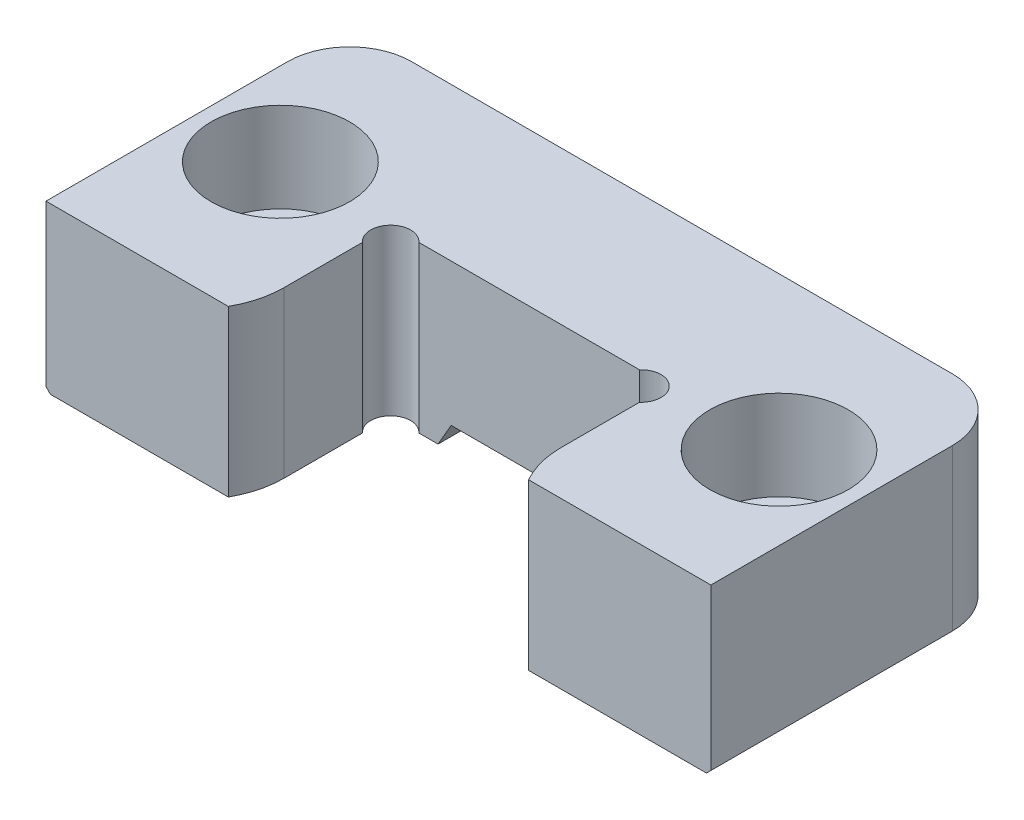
ISO-10303-21;
HEADER;
FILE_DESCRIPTION(('STEP AP214'),'2;1');
FILE_NAME('part.step','',(''),(''),'','','');
FILE_SCHEMA(('AUTOMOTIVE_DESIGN { 1 0 10303 214 1 1 1 1 }'));
ENDSEC;
DATA;
#1=APPLICATION_CONTEXT('core data for automotive mechanical design processes');
#2=APPLICATION_PROTOCOL_DEFINITION('international standard','automotive_design',2000,#1);
#3=PRODUCT_CONTEXT('',#1,'mechanical');
#4=PRODUCT('Part','Part','',(#3));
#5=PRODUCT_RELATED_PRODUCT_CATEGORY('part','',(#4));
#6=PRODUCT_DEFINITION_FORMATION('','',#4);
#7=PRODUCT_DEFINITION_CONTEXT('part definition',#1,'design');
#8=PRODUCT_DEFINITION('design','',#6,#7);
#9=PRODUCT_DEFINITION_SHAPE('','',#8);
#10=(LENGTH_UNIT() NAMED_UNIT(*) SI_UNIT(.MILLI.,.METRE.));
#11=(NAMED_UNIT(*) PLANE_ANGLE_UNIT() SI_UNIT($,.RADIAN.));
#12=(NAMED_UNIT(*) SI_UNIT($,.STERADIAN.) SOLID_ANGLE_UNIT());
#13=UNCERTAINTY_MEASURE_WITH_UNIT(LENGTH_MEASURE(1.E-05),#10,'distance_accuracy_value','');
#14=(GEOMETRIC_REPRESENTATION_CONTEXT(3) GLOBAL_UNCERTAINTY_ASSIGNED_CONTEXT((#13)) GLOBAL_UNIT_ASSIGNED_CONTEXT((#10,
#11,#12)) REPRESENTATION_CONTEXT('',''));
#15=CARTESIAN_POINT('',(0.,0.,0.));
#16=DIRECTION('',(0.,0.,1.));
#17=DIRECTION('',(1.,0.,0.));
#18=AXIS2_PLACEMENT_3D('',#15,#16,#17);
#19=CARTESIAN_POINT('',(-38.1,-18.923,-34.798));
#20=DIRECTION('',(0.,-1.,0.));
#21=DIRECTION('',(0.,0.,-1.));
#22=AXIS2_PLACEMENT_3D('',#19,#20,#21);
#23=PLANE('',#22);
#24=CARTESIAN_POINT('',(-28.575,-18.923,-17.3355));
#25=DIRECTION('',(0.,1.,0.));
#26=DIRECTION('',(0.,0.,1.));
#27=AXIS2_PLACEMENT_3D('',#24,#25,#26);
#28=CIRCLE('',#27,5.15873999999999);
#29=CARTESIAN_POINT('',(-28.575,-18.923,-12.17676));
#30=VERTEX_POINT('',#29);
#31=EDGE_CURVE('E498',#30,#30,#28,.T.);
#32=ORIENTED_EDGE('',*,*,#31,.T.);
#33=EDGE_LOOP('',(#32));
#34=FACE_BOUND('',#33,.T.);
#35=CARTESIAN_POINT('',(-30.988,-18.923,-27.686));
#36=DIRECTION('',(0.,-1.,0.));
#37=DIRECTION('',(0.,0.,-1.));
#38=AXIS2_PLACEMENT_3D('',#35,#36,#37);
#39=CIRCLE('',#38,6.604);
#40=CARTESIAN_POINT('',(-37.592,-18.923,-27.686));
#41=VERTEX_POINT('',#40);
#42=CARTESIAN_POINT('',(-30.988,-18.923,-34.29));
#43=VERTEX_POINT('',#42);
#44=EDGE_CURVE('E342',#41,#43,#39,.T.);
#45=ORIENTED_EDGE('',*,*,#44,.T.);
#46=DIRECTION('',(1.,0.,0.));
#47=VECTOR('',#46,1.);
#48=CARTESIAN_POINT('',(-38.1,-18.923,-34.29));
#49=LINE('',#48,#47);
#50=CARTESIAN_POINT('',(-10.4415435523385,-18.923,-34.29));
#51=VERTEX_POINT('',#50);
#52=EDGE_CURVE('E344',#43,#51,#49,.T.);
#53=ORIENTED_EDGE('',*,*,#52,.T.);
#54=DIRECTION('',(0.,0.,-1.));
#55=VECTOR('',#54,1.);
#56=CARTESIAN_POINT('',(-10.4415435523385,-18.923,-34.798));
#57=LINE('',#56,#55);
#58=CARTESIAN_POINT('',(-10.4415435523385,-18.923,-17.272));
#59=VERTEX_POINT('',#58);
#60=EDGE_CURVE('E319',#59,#51,#57,.T.);
#61=ORIENTED_EDGE('',*,*,#60,.F.);
#62=DIRECTION('',(1.,0.,0.));
#63=VECTOR('',#62,1.);
#64=CARTESIAN_POINT('',(-15.875,-18.923,-17.272));
#65=LINE('',#64,#63);
#66=CARTESIAN_POINT('',(-12.6471162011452,-18.923,-17.272));
#67=VERTEX_POINT('',#66);
#68=EDGE_CURVE('E270',#67,#59,#65,.T.);
#69=ORIENTED_EDGE('',*,*,#68,.F.);
#70=CARTESIAN_POINT('',(-14.351,-18.923,-15.748));
#71=DIRECTION('',(0.,1.,0.));
#72=DIRECTION('',(0.,0.,1.));
#73=AXIS2_PLACEMENT_3D('',#70,#71,#72);
#74=CIRCLE('',#73,2.286);
#75=CARTESIAN_POINT('',(-15.875,-18.923,-14.0441162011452));
#76=VERTEX_POINT('',#75);
#77=EDGE_CURVE('E232',#67,#76,#74,.T.);
#78=ORIENTED_EDGE('',*,*,#77,.T.);
#79=DIRECTION('',(0.,0.,-1.));
#80=VECTOR('',#79,1.);
#81=CARTESIAN_POINT('',(-15.875,-18.923,0.));
#82=LINE('',#81,#80);
#83=CARTESIAN_POINT('',(-15.875,-18.923,-5.08));
#84=VERTEX_POINT('',#83);
#85=EDGE_CURVE('E265',#84,#76,#82,.T.);
#86=ORIENTED_EDGE('',*,*,#85,.F.);
#87=CARTESIAN_POINT('',(-26.2282698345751,-18.923,-5.08));
#88=DIRECTION('',(0.,-1.,0.));
#89=DIRECTION('',(0.,0.,1.));
#90=AXIS2_PLACEMENT_3D('',#87,#88,#89);
#91=CIRCLE('',#90,10.3532698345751);
#92=CARTESIAN_POINT('',(-17.2069730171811,-18.923,0.));
#93=VERTEX_POINT('',#92);
#94=EDGE_CURVE('E241',#84,#93,#91,.T.);
#95=ORIENTED_EDGE('',*,*,#94,.T.);
#96=DIRECTION('',(1.,0.,0.));
#97=VECTOR('',#96,1.);
#98=CARTESIAN_POINT('',(-38.1,-18.923,0.));
#99=LINE('',#98,#97);
#100=CARTESIAN_POINT('',(-37.592,-18.923,0.));
#101=VERTEX_POINT('',#100);
#102=EDGE_CURVE('E263',#101,#93,#99,.T.);
#103=ORIENTED_EDGE('',*,*,#102,.F.);
#104=DIRECTION('',(0.,0.,-1.));
#105=VECTOR('',#104,1.);
#106=CARTESIAN_POINT('',(-37.592,-18.923,-34.798));
#107=LINE('',#106,#105);
#108=EDGE_CURVE('E340',#101,#41,#107,.T.);
#109=ORIENTED_EDGE('',*,*,#108,.T.);
#110=EDGE_LOOP('',(#45,#53,#61,#69,#78,#86,#95,#103,#109));
#111=FACE_BOUND('',#110,.T.);
#112=ADVANCED_FACE('F34',(#34,#111),#23,.T.);
#113=CARTESIAN_POINT('',(-38.1,-18.923,0.));
#114=DIRECTION('',(-1.,0.,0.));
#115=DIRECTION('',(0.,0.,1.));
#116=AXIS2_PLACEMENT_3D('',#113,#114,#115);
#117=PLANE('',#116);
#118=DIRECTION('',(0.,1.,0.));
#119=VECTOR('',#118,1.);
#120=CARTESIAN_POINT('',(-38.1,-18.923,-27.686));
#121=LINE('',#120,#119);
#122=CARTESIAN_POINT('',(-38.1,0.,-27.686));
#123=VERTEX_POINT('',#122);
#124=CARTESIAN_POINT('',(-38.1,-18.415,-27.686));
#125=VERTEX_POINT('',#124);
#126=EDGE_CURVE('E311',#123,#125,#121,.F.);
#127=ORIENTED_EDGE('',*,*,#126,.T.);
#128=DIRECTION('',(0.,0.,1.));
#129=VECTOR('',#128,1.);
#130=CARTESIAN_POINT('',(-38.1,-18.415,0.));
#131=LINE('',#130,#129);
#132=CARTESIAN_POINT('',(-38.1,-18.415,0.));
#133=VERTEX_POINT('',#132);
#134=EDGE_CURVE('E349',#125,#133,#131,.T.);
#135=ORIENTED_EDGE('',*,*,#134,.T.);
#136=DIRECTION('',(0.,1.,0.));
#137=VECTOR('',#136,1.);
#138=CARTESIAN_POINT('',(-38.1,-18.923,0.));
#139=LINE('',#138,#137);
#140=CARTESIAN_POINT('',(-38.1,0.,0.));
#141=VERTEX_POINT('',#140);
#142=EDGE_CURVE('E277',#133,#141,#139,.T.);
#143=ORIENTED_EDGE('',*,*,#142,.T.);
#144=DIRECTION('',(0.,0.,1.));
#145=VECTOR('',#144,1.);
#146=CARTESIAN_POINT('',(-38.1,0.,0.));
#147=LINE('',#146,#145);
#148=EDGE_CURVE('E255',#123,#141,#147,.T.);
#149=ORIENTED_EDGE('',*,*,#148,.F.);
#150=EDGE_LOOP('',(#127,#135,#143,#149));
#151=FACE_BOUND('',#150,.T.);
#152=ADVANCED_FACE('F424',(#151),#117,.T.);
#153=CARTESIAN_POINT('',(-38.1,-18.923,-34.798));
#154=DIRECTION('',(0.,0.,-1.));
#155=DIRECTION('',(-1.,0.,0.));
#156=AXIS2_PLACEMENT_3D('',#153,#154,#155);
#157=PLANE('',#156);
#158=DIRECTION('',(0.,1.,0.));
#159=VECTOR('',#158,1.);
#160=CARTESIAN_POINT('',(30.988,-18.923,-34.798));
#161=LINE('',#160,#159);
#162=CARTESIAN_POINT('',(30.988,0.,-34.798));
#163=VERTEX_POINT('',#162);
#164=CARTESIAN_POINT('',(30.988,-18.415,-34.798));
#165=VERTEX_POINT('',#164);
#166=EDGE_CURVE('E309',#163,#165,#161,.F.);
#167=ORIENTED_EDGE('',*,*,#166,.T.);
#168=DIRECTION('',(-1.,0.,0.));
#169=VECTOR('',#168,1.);
#170=CARTESIAN_POINT('',(-38.1,-18.415,-34.798));
#171=LINE('',#170,#169);
#172=CARTESIAN_POINT('',(10.1482496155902,-18.415,-34.798));
#173=VERTEX_POINT('',#172);
#174=EDGE_CURVE('E336',#165,#173,#171,.T.);
#175=ORIENTED_EDGE('',*,*,#174,.T.);
#176=DIRECTION('',(0.5,-0.866025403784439,0.));
#177=VECTOR('',#176,1.);
#178=CARTESIAN_POINT('',(9.525,-17.3355,-34.798));
#179=LINE('',#178,#177);
#180=CARTESIAN_POINT('',(9.525,-17.3355,-34.798));
#181=VERTEX_POINT('',#180);
#182=EDGE_CURVE('E200',#181,#173,#179,.T.);
#183=ORIENTED_EDGE('',*,*,#182,.F.);
#184=DIRECTION('',(1.,0.,0.));
#185=VECTOR('',#184,1.);
#186=CARTESIAN_POINT('',(9.525,-17.3355,-34.798));
#187=LINE('',#186,#185);
#188=CARTESIAN_POINT('',(-9.525,-17.3355,-34.798));
#189=VERTEX_POINT('',#188);
#190=EDGE_CURVE('E194',#189,#181,#187,.T.);
#191=ORIENTED_EDGE('',*,*,#190,.F.);
#192=DIRECTION('',(0.5,0.866025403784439,0.));
#193=VECTOR('',#192,1.);
#194=CARTESIAN_POINT('',(-9.525,-17.3355,-34.798));
#195=LINE('',#194,#193);
#196=CARTESIAN_POINT('',(-10.1482496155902,-18.415,-34.798));
#197=VERTEX_POINT('',#196);
#198=EDGE_CURVE('E203',#197,#189,#195,.T.);
#199=ORIENTED_EDGE('',*,*,#198,.F.);
#200=DIRECTION('',(-1.,0.,0.));
#201=VECTOR('',#200,1.);
#202=CARTESIAN_POINT('',(-38.1,-18.415,-34.798));
#203=LINE('',#202,#201);
#204=CARTESIAN_POINT('',(-30.988,-18.415,-34.798));
#205=VERTEX_POINT('',#204);
#206=EDGE_CURVE('E334',#197,#205,#203,.T.);
#207=ORIENTED_EDGE('',*,*,#206,.T.);
#208=DIRECTION('',(0.,1.,0.));
#209=VECTOR('',#208,1.);
#210=CARTESIAN_POINT('',(-30.988,-18.923,-34.798));
#211=LINE('',#210,#209);
#212=CARTESIAN_POINT('',(-30.988,0.,-34.798));
#213=VERTEX_POINT('',#212);
#214=EDGE_CURVE('E307',#205,#213,#211,.T.);
#215=ORIENTED_EDGE('',*,*,#214,.T.);
#216=DIRECTION('',(-1.,0.,0.));
#217=VECTOR('',#216,1.);
#218=CARTESIAN_POINT('',(-38.1,0.,-34.798));
#219=LINE('',#218,#217);
#220=EDGE_CURVE('E266',#163,#213,#219,.T.);
#221=ORIENTED_EDGE('',*,*,#220,.F.);
#222=EDGE_LOOP('',(#167,#175,#183,#191,#199,#207,#215,#221));
#223=FACE_BOUND('',#222,.T.);
#224=ADVANCED_FACE('F214',(#223),#157,.T.);
#225=CARTESIAN_POINT('',(38.1,-18.923,0.));
#226=DIRECTION('',(1.,0.,0.));
#227=DIRECTION('',(0.,0.,-1.));
#228=AXIS2_PLACEMENT_3D('',#225,#226,#227);
#229=PLANE('',#228);
#230=DIRECTION('',(0.,1.,0.));
#231=VECTOR('',#230,1.);
#232=CARTESIAN_POINT('',(38.1,-18.923,0.));
#233=LINE('',#232,#231);
#234=CARTESIAN_POINT('',(38.1,-18.415,0.));
#235=VERTEX_POINT('',#234);
#236=CARTESIAN_POINT('',(38.1,0.,0.));
#237=VERTEX_POINT('',#236);
#238=EDGE_CURVE('E298',#235,#237,#233,.T.);
#239=ORIENTED_EDGE('',*,*,#238,.F.);
#240=DIRECTION('',(0.,0.,-1.));
#241=VECTOR('',#240,1.);
#242=CARTESIAN_POINT('',(38.1,-18.415,0.));
#243=LINE('',#242,#241);
#244=CARTESIAN_POINT('',(38.1,-18.415,-27.686));
#245=VERTEX_POINT('',#244);
#246=EDGE_CURVE('E321',#235,#245,#243,.T.);
#247=ORIENTED_EDGE('',*,*,#246,.T.);
#248=DIRECTION('',(0.,1.,0.));
#249=VECTOR('',#248,1.);
#250=CARTESIAN_POINT('',(38.1,-18.923,-27.686));
#251=LINE('',#250,#249);
#252=CARTESIAN_POINT('',(38.1,0.,-27.686));
#253=VERTEX_POINT('',#252);
#254=EDGE_CURVE('E300',#245,#253,#251,.T.);
#255=ORIENTED_EDGE('',*,*,#254,.T.);
#256=DIRECTION('',(0.,0.,-1.));
#257=VECTOR('',#256,1.);
#258=CARTESIAN_POINT('',(38.1,0.,0.));
#259=LINE('',#258,#257);
#260=EDGE_CURVE('E293',#237,#253,#259,.T.);
#261=ORIENTED_EDGE('',*,*,#260,.F.);
#262=EDGE_LOOP('',(#239,#247,#255,#261));
#263=FACE_BOUND('',#262,.T.);
#264=ADVANCED_FACE('F410',(#263),#229,.T.);
#265=CARTESIAN_POINT('',(15.875,-18.923,0.));
#266=DIRECTION('',(0.,0.,1.));
#267=DIRECTION('',(1.,0.,0.));
#268=AXIS2_PLACEMENT_3D('',#265,#266,#267);
#269=PLANE('',#268);
#270=DIRECTION('',(1.,0.,0.));
#271=VECTOR('',#270,1.);
#272=CARTESIAN_POINT('',(15.875,-18.923,0.));
#273=LINE('',#272,#271);
#274=CARTESIAN_POINT('',(17.2069730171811,-18.923,0.));
#275=VERTEX_POINT('',#274);
#276=CARTESIAN_POINT('',(37.592,-18.923,0.));
#277=VERTEX_POINT('',#276);
#278=EDGE_CURVE('E274',#275,#277,#273,.T.);
#279=ORIENTED_EDGE('',*,*,#278,.T.);
#280=DIRECTION('',(-0.707106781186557,-0.707106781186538,0.));
#281=VECTOR('',#280,1.);
#282=CARTESIAN_POINT('',(26.7334999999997,-29.7815,0.));
#283=LINE('',#282,#281);
#284=EDGE_CURVE('E330',#277,#235,#283,.F.);
#285=ORIENTED_EDGE('',*,*,#284,.T.);
#286=ORIENTED_EDGE('',*,*,#238,.T.);
#287=DIRECTION('',(1.,0.,0.));
#288=VECTOR('',#287,1.);
#289=CARTESIAN_POINT('',(15.875,0.,0.));
#290=LINE('',#289,#288);
#291=CARTESIAN_POINT('',(17.2069730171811,0.,0.));
#292=VERTEX_POINT('',#291);
#293=EDGE_CURVE('E290',#292,#237,#290,.T.);
#294=ORIENTED_EDGE('',*,*,#293,.F.);
#295=DIRECTION('',(0.,1.,0.));
#296=VECTOR('',#295,1.);
#297=CARTESIAN_POINT('',(17.2069730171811,-18.923,0.));
#298=LINE('',#297,#296);
#299=EDGE_CURVE('E259',#275,#292,#298,.T.);
#300=ORIENTED_EDGE('',*,*,#299,.F.);
#301=EDGE_LOOP('',(#279,#285,#286,#294,#300));
#302=FACE_BOUND('',#301,.T.);
#303=ADVANCED_FACE('F393',(#302),#269,.T.);
#304=CARTESIAN_POINT('',(15.875,-18.923,0.));
#305=DIRECTION('',(-1.,0.,0.));
#306=DIRECTION('',(0.,0.,1.));
#307=AXIS2_PLACEMENT_3D('',#304,#305,#306);
#308=PLANE('',#307);
#309=DIRECTION('',(0.,1.,0.));
#310=VECTOR('',#309,1.);
#311=CARTESIAN_POINT('',(15.875,-18.923,-14.0441162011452));
#312=LINE('',#311,#310);
#313=CARTESIAN_POINT('',(15.875,-18.923,-14.0441162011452));
#314=VERTEX_POINT('',#313);
#315=CARTESIAN_POINT('',(15.875,0.,-14.0441162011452));
#316=VERTEX_POINT('',#315);
#317=EDGE_CURVE('E229',#314,#316,#312,.T.);
#318=ORIENTED_EDGE('',*,*,#317,.F.);
#319=DIRECTION('',(0.,0.,1.));
#320=VECTOR('',#319,1.);
#321=CARTESIAN_POINT('',(15.875,-18.923,0.));
#322=LINE('',#321,#320);
#323=CARTESIAN_POINT('',(15.875,-18.923,-5.08));
#324=VERTEX_POINT('',#323);
#325=EDGE_CURVE('E272',#314,#324,#322,.T.);
#326=ORIENTED_EDGE('',*,*,#325,.T.);
#327=DIRECTION('',(0.,1.,0.));
#328=VECTOR('',#327,1.);
#329=CARTESIAN_POINT('',(15.875,-18.923,-5.08));
#330=LINE('',#329,#328);
#331=CARTESIAN_POINT('',(15.875,0.,-5.08));
#332=VERTEX_POINT('',#331);
#333=EDGE_CURVE('E256',#324,#332,#330,.T.);
#334=ORIENTED_EDGE('',*,*,#333,.T.);
#335=DIRECTION('',(0.,0.,1.));
#336=VECTOR('',#335,1.);
#337=CARTESIAN_POINT('',(15.875,0.,0.));
#338=LINE('',#337,#336);
#339=EDGE_CURVE('E288',#316,#332,#338,.T.);
#340=ORIENTED_EDGE('',*,*,#339,.F.);
#341=EDGE_LOOP('',(#318,#326,#334,#340));
#342=FACE_BOUND('',#341,.T.);
#343=ADVANCED_FACE('F382',(#342),#308,.T.);
#344=CARTESIAN_POINT('',(-15.875,-18.923,-17.272));
#345=DIRECTION('',(0.,0.,1.));
#346=DIRECTION('',(1.,0.,0.));
#347=AXIS2_PLACEMENT_3D('',#344,#345,#346);
#348=PLANE('',#347);
#349=DIRECTION('',(-0.5,-0.866025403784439,0.));
#350=VECTOR('',#349,1.);
#351=CARTESIAN_POINT('',(-11.7999076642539,-21.2757556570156,-17.272));
#352=LINE('',#351,#350);
#353=CARTESIAN_POINT('',(-8.93559094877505,-16.3146135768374,-17.272));
#354=VERTEX_POINT('',#353);
#355=EDGE_CURVE('E49',#354,#59,#352,.T.);
#356=ORIENTED_EDGE('',*,*,#355,.F.);
#357=DIRECTION('',(1.,0.,0.));
#358=VECTOR('',#357,1.);
#359=CARTESIAN_POINT('',(9.525,-16.3146135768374,-17.272));
#360=LINE('',#359,#358);
#361=CARTESIAN_POINT('',(8.93559094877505,-16.3146135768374,-17.272));
#362=VERTEX_POINT('',#361);
#363=EDGE_CURVE('E364',#354,#362,#360,.T.);
#364=ORIENTED_EDGE('',*,*,#363,.T.);
#365=DIRECTION('',(-0.5,0.866025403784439,0.));
#366=VECTOR('',#365,1.);
#367=CARTESIAN_POINT('',(3.8624076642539,-7.52760237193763,-17.272));
#368=LINE('',#367,#366);
#369=CARTESIAN_POINT('',(10.4415435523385,-18.923,-17.272));
#370=VERTEX_POINT('',#369);
#371=EDGE_CURVE('E56',#370,#362,#368,.T.);
#372=ORIENTED_EDGE('',*,*,#371,.F.);
#373=CARTESIAN_POINT('',(12.6471162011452,-18.923,-17.272));
#374=VERTEX_POINT('',#373);
#375=EDGE_CURVE('E269',#370,#374,#65,.T.);
#376=ORIENTED_EDGE('',*,*,#375,.T.);
#377=DIRECTION('',(0.,1.,0.));
#378=VECTOR('',#377,1.);
#379=CARTESIAN_POINT('',(12.6471162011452,-18.923,-17.272));
#380=LINE('',#379,#378);
#381=CARTESIAN_POINT('',(12.6471162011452,0.,-17.272));
#382=VERTEX_POINT('',#381);
#383=EDGE_CURVE('E226',#382,#374,#380,.F.);
#384=ORIENTED_EDGE('',*,*,#383,.F.);
#385=DIRECTION('',(1.,0.,0.));
#386=VECTOR('',#385,1.);
#387=CARTESIAN_POINT('',(-15.875,0.,-17.272));
#388=LINE('',#387,#386);
#389=CARTESIAN_POINT('',(-12.6471162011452,0.,-17.272));
#390=VERTEX_POINT('',#389);
#391=EDGE_CURVE('E285',#390,#382,#388,.T.);
#392=ORIENTED_EDGE('',*,*,#391,.F.);
#393=DIRECTION('',(0.,1.,0.));
#394=VECTOR('',#393,1.);
#395=CARTESIAN_POINT('',(-12.6471162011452,-18.923,-17.272));
#396=LINE('',#395,#394);
#397=EDGE_CURVE('E238',#67,#390,#396,.T.);
#398=ORIENTED_EDGE('',*,*,#397,.F.);
#399=ORIENTED_EDGE('',*,*,#68,.T.);
#400=EDGE_LOOP('',(#356,#364,#372,#376,#384,#392,#398,#399));
#401=FACE_BOUND('',#400,.T.);
#402=ADVANCED_FACE('F369',(#401),#348,.T.);
#403=CARTESIAN_POINT('',(-15.875,-18.923,0.));
#404=DIRECTION('',(1.,0.,0.));
#405=DIRECTION('',(0.,0.,-1.));
#406=AXIS2_PLACEMENT_3D('',#403,#404,#405);
#407=PLANE('',#406);
#408=DIRECTION('',(0.,1.,0.));
#409=VECTOR('',#408,1.);
#410=CARTESIAN_POINT('',(-15.875,-18.923,-14.0441162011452));
#411=LINE('',#410,#409);
#412=CARTESIAN_POINT('',(-15.875,0.,-14.0441162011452));
#413=VERTEX_POINT('',#412);
#414=EDGE_CURVE('E235',#413,#76,#411,.F.);
#415=ORIENTED_EDGE('',*,*,#414,.F.);
#416=DIRECTION('',(0.,0.,-1.));
#417=VECTOR('',#416,1.);
#418=CARTESIAN_POINT('',(-15.875,0.,0.));
#419=LINE('',#418,#417);
#420=CARTESIAN_POINT('',(-15.875,0.,-5.08));
#421=VERTEX_POINT('',#420);
#422=EDGE_CURVE('E282',#421,#413,#419,.T.);
#423=ORIENTED_EDGE('',*,*,#422,.F.);
#424=DIRECTION('',(0.,1.,0.));
#425=VECTOR('',#424,1.);
#426=CARTESIAN_POINT('',(-15.875,-18.923,-5.08));
#427=LINE('',#426,#425);
#428=EDGE_CURVE('E253',#84,#421,#427,.T.);
#429=ORIENTED_EDGE('',*,*,#428,.F.);
#430=ORIENTED_EDGE('',*,*,#85,.T.);
#431=EDGE_LOOP('',(#415,#423,#429,#430));
#432=FACE_BOUND('',#431,.T.);
#433=ADVANCED_FACE('F448',(#432),#407,.T.);
#434=CARTESIAN_POINT('',(-38.1,-18.923,0.));
#435=DIRECTION('',(0.,0.,1.));
#436=DIRECTION('',(1.,0.,0.));
#437=AXIS2_PLACEMENT_3D('',#434,#435,#436);
#438=PLANE('',#437);
#439=ORIENTED_EDGE('',*,*,#142,.F.);
#440=DIRECTION('',(-0.707106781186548,0.707106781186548,0.));
#441=VECTOR('',#440,1.);
#442=CARTESIAN_POINT('',(-37.846,-18.669,0.));
#443=LINE('',#442,#441);
#444=EDGE_CURVE('E351',#133,#101,#443,.F.);
#445=ORIENTED_EDGE('',*,*,#444,.T.);
#446=ORIENTED_EDGE('',*,*,#102,.T.);
#447=DIRECTION('',(0.,1.,0.));
#448=VECTOR('',#447,1.);
#449=CARTESIAN_POINT('',(-17.2069730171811,-18.923,0.));
#450=LINE('',#449,#448);
#451=CARTESIAN_POINT('',(-17.2069730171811,0.,0.));
#452=VERTEX_POINT('',#451);
#453=EDGE_CURVE('E248',#93,#452,#450,.T.);
#454=ORIENTED_EDGE('',*,*,#453,.T.);
#455=DIRECTION('',(1.,0.,0.));
#456=VECTOR('',#455,1.);
#457=CARTESIAN_POINT('',(-38.1,0.,0.));
#458=LINE('',#457,#456);
#459=EDGE_CURVE('E280',#141,#452,#458,.T.);
#460=ORIENTED_EDGE('',*,*,#459,.F.);
#461=EDGE_LOOP('',(#439,#445,#446,#454,#460));
#462=FACE_BOUND('',#461,.T.);
#463=ADVANCED_FACE('F429',(#462),#438,.T.);
#464=CARTESIAN_POINT('',(28.575,-18.923,-17.3355));
#465=DIRECTION('',(0.,1.,0.));
#466=DIRECTION('',(0.,0.,1.));
#467=AXIS2_PLACEMENT_3D('',#464,#465,#466);
#468=CIRCLE('',#467,5.15873999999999);
#469=CARTESIAN_POINT('',(28.575,-18.923,-12.17676));
#470=VERTEX_POINT('',#469);
#471=EDGE_CURVE('E360',#470,#470,#468,.T.);
#472=ORIENTED_EDGE('',*,*,#471,.T.);
#473=EDGE_LOOP('',(#472));
#474=FACE_BOUND('',#473,.T.);
#475=CARTESIAN_POINT('',(30.988,-18.923,-27.686));
#476=DIRECTION('',(0.,-1.,0.));
#477=DIRECTION('',(0.,0.,-1.));
#478=AXIS2_PLACEMENT_3D('',#475,#476,#477);
#479=CIRCLE('',#478,6.60399999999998);
#480=CARTESIAN_POINT('',(30.988,-18.923,-34.29));
#481=VERTEX_POINT('',#480);
#482=CARTESIAN_POINT('',(37.592,-18.923,-27.686));
#483=VERTEX_POINT('',#482);
#484=EDGE_CURVE('E326',#481,#483,#479,.T.);
#485=ORIENTED_EDGE('',*,*,#484,.T.);
#486=DIRECTION('',(0.,0.,1.));
#487=VECTOR('',#486,1.);
#488=CARTESIAN_POINT('',(37.592,-18.923,-34.798));
#489=LINE('',#488,#487);
#490=EDGE_CURVE('E328',#483,#277,#489,.T.);
#491=ORIENTED_EDGE('',*,*,#490,.T.);
#492=ORIENTED_EDGE('',*,*,#278,.F.);
#493=CARTESIAN_POINT('',(26.2282698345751,-18.923,-5.08));
#494=DIRECTION('',(0.,-1.,0.));
#495=DIRECTION('',(0.,0.,-1.));
#496=AXIS2_PLACEMENT_3D('',#493,#494,#495);
#497=CIRCLE('',#496,10.3532698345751);
#498=EDGE_CURVE('E244',#275,#324,#497,.T.);
#499=ORIENTED_EDGE('',*,*,#498,.T.);
#500=ORIENTED_EDGE('',*,*,#325,.F.);
#501=CARTESIAN_POINT('',(14.351,-18.923,-15.748));
#502=DIRECTION('',(0.,1.,0.));
#503=DIRECTION('',(0.,0.,-1.));
#504=AXIS2_PLACEMENT_3D('',#501,#502,#503);
#505=CIRCLE('',#504,2.286);
#506=EDGE_CURVE('E223',#314,#374,#505,.T.);
#507=ORIENTED_EDGE('',*,*,#506,.T.);
#508=ORIENTED_EDGE('',*,*,#375,.F.);
#509=DIRECTION('',(0.,0.,1.));
#510=VECTOR('',#509,1.);
#511=CARTESIAN_POINT('',(10.4415435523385,-18.923,-34.798));
#512=LINE('',#511,#510);
#513=CARTESIAN_POINT('',(10.4415435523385,-18.923,-34.29));
#514=VERTEX_POINT('',#513);
#515=EDGE_CURVE('E317',#514,#370,#512,.T.);
#516=ORIENTED_EDGE('',*,*,#515,.F.);
#517=DIRECTION('',(1.,0.,0.));
#518=VECTOR('',#517,1.);
#519=CARTESIAN_POINT('',(-38.1,-18.923,-34.29));
#520=LINE('',#519,#518);
#521=EDGE_CURVE('E324',#514,#481,#520,.T.);
#522=ORIENTED_EDGE('',*,*,#521,.T.);
#523=EDGE_LOOP('',(#485,#491,#492,#499,#500,#507,#508,#516,#522));
#524=FACE_BOUND('',#523,.T.);
#525=ADVANCED_FACE('F374',(#474,#524),#23,.T.);
#526=CARTESIAN_POINT('',(-38.1,0.,-34.798));
#527=DIRECTION('',(0.,-1.,0.));
#528=DIRECTION('',(0.,0.,-1.));
#529=AXIS2_PLACEMENT_3D('',#526,#527,#528);
#530=PLANE('',#529);
#531=CARTESIAN_POINT('',(-28.575,0.,-17.3355));
#532=DIRECTION('',(0.,1.,0.));
#533=DIRECTION('',(0.,0.,1.));
#534=AXIS2_PLACEMENT_3D('',#531,#532,#533);
#535=CIRCLE('',#534,7.9375);
#536=CARTESIAN_POINT('',(-28.575,0.,-9.398));
#537=VERTEX_POINT('',#536);
#538=EDGE_CURVE('E506',#537,#537,#535,.T.);
#539=ORIENTED_EDGE('',*,*,#538,.F.);
#540=EDGE_LOOP('',(#539));
#541=FACE_BOUND('',#540,.T.);
#542=CARTESIAN_POINT('',(28.575,0.,-17.3355));
#543=DIRECTION('',(0.,1.,0.));
#544=DIRECTION('',(0.,0.,1.));
#545=AXIS2_PLACEMENT_3D('',#542,#543,#544);
#546=CIRCLE('',#545,7.9375);
#547=CARTESIAN_POINT('',(28.575,0.,-9.398));
#548=VERTEX_POINT('',#547);
#549=EDGE_CURVE('E495',#548,#548,#546,.T.);
#550=ORIENTED_EDGE('',*,*,#549,.F.);
#551=EDGE_LOOP('',(#550));
#552=FACE_BOUND('',#551,.T.);
#553=ORIENTED_EDGE('',*,*,#391,.T.);
#554=CARTESIAN_POINT('',(14.351,0.,-15.748));
#555=DIRECTION('',(0.,-1.,0.));
#556=DIRECTION('',(0.,0.,-1.));
#557=AXIS2_PLACEMENT_3D('',#554,#555,#556);
#558=CIRCLE('',#557,2.286);
#559=EDGE_CURVE('E314',#382,#316,#558,.T.);
#560=ORIENTED_EDGE('',*,*,#559,.T.);
#561=ORIENTED_EDGE('',*,*,#339,.T.);
#562=CARTESIAN_POINT('',(26.2282698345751,0.,-5.08));
#563=DIRECTION('',(0.,-1.,0.));
#564=DIRECTION('',(0.,0.,-1.));
#565=AXIS2_PLACEMENT_3D('',#562,#563,#564);
#566=CIRCLE('',#565,10.3532698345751);
#567=EDGE_CURVE('E245',#292,#332,#566,.T.);
#568=ORIENTED_EDGE('',*,*,#567,.F.);
#569=ORIENTED_EDGE('',*,*,#293,.T.);
#570=ORIENTED_EDGE('',*,*,#260,.T.);
#571=CARTESIAN_POINT('',(30.988,0.,-27.686));
#572=DIRECTION('',(0.,-1.,0.));
#573=DIRECTION('',(0.,0.,-1.));
#574=AXIS2_PLACEMENT_3D('',#571,#572,#573);
#575=CIRCLE('',#574,7.112);
#576=EDGE_CURVE('E305',#253,#163,#575,.F.);
#577=ORIENTED_EDGE('',*,*,#576,.T.);
#578=ORIENTED_EDGE('',*,*,#220,.T.);
#579=CARTESIAN_POINT('',(-30.988,0.,-27.686));
#580=DIRECTION('',(0.,-1.,0.));
#581=DIRECTION('',(0.,0.,-1.));
#582=AXIS2_PLACEMENT_3D('',#579,#580,#581);
#583=CIRCLE('',#582,7.112);
#584=EDGE_CURVE('E303',#213,#123,#583,.F.);
#585=ORIENTED_EDGE('',*,*,#584,.T.);
#586=ORIENTED_EDGE('',*,*,#148,.T.);
#587=ORIENTED_EDGE('',*,*,#459,.T.);
#588=CARTESIAN_POINT('',(-26.2282698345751,0.,-5.08));
#589=DIRECTION('',(0.,-1.,0.));
#590=DIRECTION('',(0.,0.,1.));
#591=AXIS2_PLACEMENT_3D('',#588,#589,#590);
#592=CIRCLE('',#591,10.3532698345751);
#593=EDGE_CURVE('E240',#421,#452,#592,.T.);
#594=ORIENTED_EDGE('',*,*,#593,.F.);
#595=ORIENTED_EDGE('',*,*,#422,.T.);
#596=CARTESIAN_POINT('',(-14.351,0.,-15.748));
#597=DIRECTION('',(0.,1.,0.));
#598=DIRECTION('',(0.,0.,1.));
#599=AXIS2_PLACEMENT_3D('',#596,#597,#598);
#600=CIRCLE('',#599,2.286);
#601=EDGE_CURVE('E231',#390,#413,#600,.T.);
#602=ORIENTED_EDGE('',*,*,#601,.F.);
#603=EDGE_LOOP('',(#553,#560,#561,#568,#569,#570,#577,#578,#585,#586,#587,#594,#595,#602));
#604=FACE_BOUND('',#603,.T.);
#605=ADVANCED_FACE('F386',(#541,#552,#604),#530,.F.);
#606=CARTESIAN_POINT('',(30.988,-18.923,-27.686));
#607=DIRECTION('',(0.,1.,0.));
#608=DIRECTION('',(0.,0.,1.));
#609=AXIS2_PLACEMENT_3D('',#606,#607,#608);
#610=CYLINDRICAL_SURFACE('',#609,7.112);
#611=ORIENTED_EDGE('',*,*,#254,.F.);
#612=CARTESIAN_POINT('',(30.988,-18.415,-27.686));
#613=DIRECTION('',(0.,-1.,0.));
#614=DIRECTION('',(0.,0.,-1.));
#615=AXIS2_PLACEMENT_3D('',#612,#613,#614);
#616=CIRCLE('',#615,7.112);
#617=EDGE_CURVE('E332',#245,#165,#616,.F.);
#618=ORIENTED_EDGE('',*,*,#617,.T.);
#619=ORIENTED_EDGE('',*,*,#166,.F.);
#620=ORIENTED_EDGE('',*,*,#576,.F.);
#621=EDGE_LOOP('',(#611,#618,#619,#620));
#622=FACE_BOUND('',#621,.T.);
#623=ADVANCED_FACE('F413',(#622),#610,.T.);
#624=CARTESIAN_POINT('',(-30.988,-18.923,-27.686));
#625=DIRECTION('',(0.,1.,0.));
#626=DIRECTION('',(0.,0.,1.));
#627=AXIS2_PLACEMENT_3D('',#624,#625,#626);
#628=CYLINDRICAL_SURFACE('',#627,7.112);
#629=ORIENTED_EDGE('',*,*,#214,.F.);
#630=CARTESIAN_POINT('',(-30.988,-18.415,-27.686));
#631=DIRECTION('',(0.,-1.,0.));
#632=DIRECTION('',(0.,0.,-1.));
#633=AXIS2_PLACEMENT_3D('',#630,#631,#632);
#634=CIRCLE('',#633,7.112);
#635=EDGE_CURVE('E347',#205,#125,#634,.F.);
#636=ORIENTED_EDGE('',*,*,#635,.T.);
#637=ORIENTED_EDGE('',*,*,#126,.F.);
#638=ORIENTED_EDGE('',*,*,#584,.F.);
#639=EDGE_LOOP('',(#629,#636,#637,#638));
#640=FACE_BOUND('',#639,.T.);
#641=ADVANCED_FACE('F420',(#640),#628,.T.);
#642=CARTESIAN_POINT('',(26.2282698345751,-18.923,-5.08));
#643=DIRECTION('',(0.,1.,0.));
#644=DIRECTION('',(0.,0.,1.));
#645=AXIS2_PLACEMENT_3D('',#642,#643,#644);
#646=CYLINDRICAL_SURFACE('',#645,10.3532698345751);
#647=ORIENTED_EDGE('',*,*,#567,.T.);
#648=ORIENTED_EDGE('',*,*,#333,.F.);
#649=ORIENTED_EDGE('',*,*,#498,.F.);
#650=ORIENTED_EDGE('',*,*,#299,.T.);
#651=EDGE_LOOP('',(#647,#648,#649,#650));
#652=FACE_BOUND('',#651,.T.);
#653=ADVANCED_FACE('F389',(#652),#646,.T.);
#654=CARTESIAN_POINT('',(-26.2282698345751,-18.923,-5.08));
#655=DIRECTION('',(0.,1.,0.));
#656=DIRECTION('',(0.,0.,1.));
#657=AXIS2_PLACEMENT_3D('',#654,#655,#656);
#658=CYLINDRICAL_SURFACE('',#657,10.3532698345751);
#659=ORIENTED_EDGE('',*,*,#593,.T.);
#660=ORIENTED_EDGE('',*,*,#453,.F.);
#661=ORIENTED_EDGE('',*,*,#94,.F.);
#662=ORIENTED_EDGE('',*,*,#428,.T.);
#663=EDGE_LOOP('',(#659,#660,#661,#662));
#664=FACE_BOUND('',#663,.T.);
#665=ADVANCED_FACE('F441',(#664),#658,.T.);
#666=CARTESIAN_POINT('',(-14.351,-18.923,-15.748));
#667=DIRECTION('',(0.,1.,0.));
#668=DIRECTION('',(0.,0.,1.));
#669=AXIS2_PLACEMENT_3D('',#666,#667,#668);
#670=CYLINDRICAL_SURFACE('',#669,2.286);
#671=ORIENTED_EDGE('',*,*,#397,.T.);
#672=ORIENTED_EDGE('',*,*,#601,.T.);
#673=ORIENTED_EDGE('',*,*,#414,.T.);
#674=ORIENTED_EDGE('',*,*,#77,.F.);
#675=EDGE_LOOP('',(#671,#672,#673,#674));
#676=FACE_BOUND('',#675,.T.);
#677=ADVANCED_FACE('F450',(#676),#670,.F.);
#678=CARTESIAN_POINT('',(14.351,-18.923,-15.748));
#679=DIRECTION('',(0.,1.,0.));
#680=DIRECTION('',(0.,0.,1.));
#681=AXIS2_PLACEMENT_3D('',#678,#679,#680);
#682=CYLINDRICAL_SURFACE('',#681,2.286);
#683=ORIENTED_EDGE('',*,*,#317,.T.);
#684=ORIENTED_EDGE('',*,*,#559,.F.);
#685=ORIENTED_EDGE('',*,*,#383,.T.);
#686=ORIENTED_EDGE('',*,*,#506,.F.);
#687=EDGE_LOOP('',(#683,#684,#685,#686));
#688=FACE_BOUND('',#687,.T.);
#689=ADVANCED_FACE('F379',(#688),#682,.F.);
#690=CARTESIAN_POINT('',(-9.525,-17.3355,0.));
#691=DIRECTION('',(-0.866025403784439,0.5,0.));
#692=DIRECTION('',(-0.5,-0.866025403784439,0.));
#693=AXIS2_PLACEMENT_3D('',#690,#691,#692);
#694=PLANE('',#693);
#695=ORIENTED_EDGE('',*,*,#60,.T.);
#696=DIRECTION('',(-0.377964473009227,-0.654653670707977,0.654653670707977));
#697=VECTOR('',#696,1.);
#698=CARTESIAN_POINT('',(-14.141356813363,-25.3312645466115,-27.8817354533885));
#699=LINE('',#698,#697);
#700=EDGE_CURVE('E207',#51,#197,#699,.F.);
#701=ORIENTED_EDGE('',*,*,#700,.T.);
#702=ORIENTED_EDGE('',*,*,#198,.T.);
#703=DIRECTION('',(0.,0.,-1.));
#704=VECTOR('',#703,1.);
#705=CARTESIAN_POINT('',(-9.525,-17.3355,0.));
#706=LINE('',#705,#704);
#707=CARTESIAN_POINT('',(-9.525,-17.3355,-21.0820000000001));
#708=VERTEX_POINT('',#707);
#709=EDGE_CURVE('E189',#708,#189,#706,.T.);
#710=ORIENTED_EDGE('',*,*,#709,.F.);
#711=DIRECTION('',(0.147788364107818,0.25597695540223,0.955319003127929));
#712=VECTOR('',#711,1.);
#713=CARTESIAN_POINT('',(-6.54853714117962,-12.1801151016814,-1.84184162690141));
#714=LINE('',#713,#712);
#715=EDGE_CURVE('E42',#708,#354,#714,.T.);
#716=ORIENTED_EDGE('',*,*,#715,.T.);
#717=ORIENTED_EDGE('',*,*,#355,.T.);
#718=EDGE_LOOP('',(#695,#701,#702,#710,#716,#717));
#719=FACE_BOUND('',#718,.T.);
#720=ADVANCED_FACE('F205',(#719),#694,.F.);
#721=CARTESIAN_POINT('',(9.525,-17.3355,0.));
#722=DIRECTION('',(0.866025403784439,0.5,0.));
#723=DIRECTION('',(-0.5,0.866025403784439,0.));
#724=AXIS2_PLACEMENT_3D('',#721,#722,#723);
#725=PLANE('',#724);
#726=ORIENTED_EDGE('',*,*,#182,.T.);
#727=DIRECTION('',(-0.377964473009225,0.654653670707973,-0.654653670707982));
#728=VECTOR('',#727,1.);
#729=CARTESIAN_POINT('',(3.25564252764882,-6.47665432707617,-46.736345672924));
#730=LINE('',#729,#728);
#731=EDGE_CURVE('E338',#173,#514,#730,.F.);
#732=ORIENTED_EDGE('',*,*,#731,.T.);
#733=ORIENTED_EDGE('',*,*,#515,.T.);
#734=ORIENTED_EDGE('',*,*,#371,.T.);
#735=DIRECTION('',(0.147788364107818,-0.25597695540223,-0.955319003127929));
#736=VECTOR('',#735,1.);
#737=CARTESIAN_POINT('',(6.54853714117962,-12.1801151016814,-1.84184162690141));
#738=LINE('',#737,#736);
#739=CARTESIAN_POINT('',(9.525,-17.3355,-21.0820000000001));
#740=VERTEX_POINT('',#739);
#741=EDGE_CURVE('E11',#362,#740,#738,.T.);
#742=ORIENTED_EDGE('',*,*,#741,.T.);
#743=DIRECTION('',(0.,0.,-1.));
#744=VECTOR('',#743,1.);
#745=CARTESIAN_POINT('',(9.525,-17.3355,0.));
#746=LINE('',#745,#744);
#747=EDGE_CURVE('E199',#740,#181,#746,.T.);
#748=ORIENTED_EDGE('',*,*,#747,.T.);
#749=EDGE_LOOP('',(#726,#732,#733,#734,#742,#748));
#750=FACE_BOUND('',#749,.T.);
#751=ADVANCED_FACE('F535',(#750),#725,.F.);
#752=CARTESIAN_POINT('',(9.525,-17.3355,0.));
#753=DIRECTION('',(0.,1.,0.));
#754=DIRECTION('',(0.,0.,1.));
#755=AXIS2_PLACEMENT_3D('',#752,#753,#754);
#756=PLANE('',#755);
#757=ORIENTED_EDGE('',*,*,#747,.F.);
#758=DIRECTION('',(-1.,0.,0.));
#759=VECTOR('',#758,1.);
#760=CARTESIAN_POINT('',(-9.525,-17.3355,-21.0820000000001));
#761=LINE('',#760,#759);
#762=EDGE_CURVE('E197',#740,#708,#761,.T.);
#763=ORIENTED_EDGE('',*,*,#762,.T.);
#764=ORIENTED_EDGE('',*,*,#709,.T.);
#765=ORIENTED_EDGE('',*,*,#190,.T.);
#766=EDGE_LOOP('',(#757,#763,#764,#765));
#767=FACE_BOUND('',#766,.T.);
#768=ADVANCED_FACE('F192',(#767),#756,.F.);
#769=CARTESIAN_POINT('',(-38.1,-18.415,-34.798));
#770=DIRECTION('',(0.,0.707106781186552,0.707106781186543));
#771=DIRECTION('',(0.,-0.707106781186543,0.707106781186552));
#772=AXIS2_PLACEMENT_3D('',#769,#770,#771);
#773=PLANE('',#772);
#774=ORIENTED_EDGE('',*,*,#731,.F.);
#775=ORIENTED_EDGE('',*,*,#174,.F.);
#776=DIRECTION('',(0.,0.707106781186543,-0.707106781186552));
#777=VECTOR('',#776,1.);
#778=CARTESIAN_POINT('',(30.988,-18.923,-34.29));
#779=LINE('',#778,#777);
#780=EDGE_CURVE('E211',#481,#165,#779,.T.);
#781=ORIENTED_EDGE('',*,*,#780,.F.);
#782=ORIENTED_EDGE('',*,*,#521,.F.);
#783=EDGE_LOOP('',(#774,#775,#781,#782));
#784=FACE_BOUND('',#783,.T.);
#785=ADVANCED_FACE('F540',(#784),#773,.F.);
#786=CARTESIAN_POINT('',(30.988,-18.923,-27.686));
#787=DIRECTION('',(0.,1.,0.));
#788=DIRECTION('',(0.,0.,1.));
#789=AXIS2_PLACEMENT_3D('',#786,#787,#788);
#790=CONICAL_SURFACE('',#789,6.60399999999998,0.785398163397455);
#791=ORIENTED_EDGE('',*,*,#780,.T.);
#792=ORIENTED_EDGE('',*,*,#617,.F.);
#793=DIRECTION('',(0.707106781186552,0.707106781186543,0.));
#794=VECTOR('',#793,1.);
#795=CARTESIAN_POINT('',(37.592,-18.923,-27.686));
#796=LINE('',#795,#794);
#797=EDGE_CURVE('E353',#483,#245,#796,.T.);
#798=ORIENTED_EDGE('',*,*,#797,.F.);
#799=ORIENTED_EDGE('',*,*,#484,.F.);
#800=EDGE_LOOP('',(#791,#792,#798,#799));
#801=FACE_BOUND('',#800,.T.);
#802=ADVANCED_FACE('F403',(#801),#790,.T.);
#803=CARTESIAN_POINT('',(38.1,-18.415,0.));
#804=DIRECTION('',(-0.707106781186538,0.707106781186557,0.));
#805=DIRECTION('',(-0.707106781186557,-0.707106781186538,0.));
#806=AXIS2_PLACEMENT_3D('',#803,#804,#805);
#807=PLANE('',#806);
#808=ORIENTED_EDGE('',*,*,#284,.F.);
#809=ORIENTED_EDGE('',*,*,#490,.F.);
#810=ORIENTED_EDGE('',*,*,#797,.T.);
#811=ORIENTED_EDGE('',*,*,#246,.F.);
#812=EDGE_LOOP('',(#808,#809,#810,#811));
#813=FACE_BOUND('',#812,.T.);
#814=ADVANCED_FACE('F399',(#813),#807,.F.);
#815=CARTESIAN_POINT('',(-38.1,-18.415,0.));
#816=DIRECTION('',(0.707106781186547,0.707106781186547,0.));
#817=DIRECTION('',(-0.707106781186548,0.707106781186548,0.));
#818=AXIS2_PLACEMENT_3D('',#815,#816,#817);
#819=PLANE('',#818);
#820=ORIENTED_EDGE('',*,*,#444,.F.);
#821=ORIENTED_EDGE('',*,*,#134,.F.);
#822=DIRECTION('',(-0.707106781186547,0.707106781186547,0.));
#823=VECTOR('',#822,1.);
#824=CARTESIAN_POINT('',(-37.592,-18.923,-27.686));
#825=LINE('',#824,#823);
#826=EDGE_CURVE('E355',#41,#125,#825,.T.);
#827=ORIENTED_EDGE('',*,*,#826,.F.);
#828=ORIENTED_EDGE('',*,*,#108,.F.);
#829=EDGE_LOOP('',(#820,#821,#827,#828));
#830=FACE_BOUND('',#829,.T.);
#831=ADVANCED_FACE('F433',(#830),#819,.F.);
#832=CARTESIAN_POINT('',(-30.988,-18.923,-27.686));
#833=DIRECTION('',(0.,1.,0.));
#834=DIRECTION('',(0.,0.,1.));
#835=AXIS2_PLACEMENT_3D('',#832,#833,#834);
#836=CONICAL_SURFACE('',#835,6.604,0.785398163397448);
#837=ORIENTED_EDGE('',*,*,#826,.T.);
#838=ORIENTED_EDGE('',*,*,#635,.F.);
#839=DIRECTION('',(0.,0.707106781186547,-0.707106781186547));
#840=VECTOR('',#839,1.);
#841=CARTESIAN_POINT('',(-30.988,-18.923,-34.29));
#842=LINE('',#841,#840);
#843=EDGE_CURVE('E358',#43,#205,#842,.T.);
#844=ORIENTED_EDGE('',*,*,#843,.F.);
#845=ORIENTED_EDGE('',*,*,#44,.F.);
#846=EDGE_LOOP('',(#837,#838,#844,#845));
#847=FACE_BOUND('',#846,.T.);
#848=ADVANCED_FACE('F459',(#847),#836,.T.);
#849=CARTESIAN_POINT('',(-38.1,-18.415,-34.798));
#850=DIRECTION('',(0.,0.707106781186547,0.707106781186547));
#851=DIRECTION('',(0.,-0.707106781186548,0.707106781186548));
#852=AXIS2_PLACEMENT_3D('',#849,#850,#851);
#853=PLANE('',#852);
#854=ORIENTED_EDGE('',*,*,#700,.F.);
#855=ORIENTED_EDGE('',*,*,#52,.F.);
#856=ORIENTED_EDGE('',*,*,#843,.T.);
#857=ORIENTED_EDGE('',*,*,#206,.F.);
#858=EDGE_LOOP('',(#854,#855,#856,#857));
#859=FACE_BOUND('',#858,.T.);
#860=ADVANCED_FACE('F455',(#859),#853,.F.);
#861=CARTESIAN_POINT('',(9.525,-17.3355,-21.0820000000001));
#862=DIRECTION('',(0.,-0.965925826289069,0.258819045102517));
#863=DIRECTION('',(0.,-0.258819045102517,-0.965925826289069));
#864=AXIS2_PLACEMENT_3D('',#861,#862,#863);
#865=PLANE('',#864);
#866=ORIENTED_EDGE('',*,*,#741,.F.);
#867=ORIENTED_EDGE('',*,*,#363,.F.);
#868=ORIENTED_EDGE('',*,*,#715,.F.);
#869=ORIENTED_EDGE('',*,*,#762,.F.);
#870=EDGE_LOOP('',(#866,#867,#868,#869));
#871=FACE_BOUND('',#870,.T.);
#872=ADVANCED_FACE('F36',(#871),#865,.T.);
#873=CARTESIAN_POINT('',(28.575,0.,-17.3355));
#874=DIRECTION('',(0.,1.,0.));
#875=DIRECTION('',(0.,0.,1.));
#876=AXIS2_PLACEMENT_3D('',#873,#874,#875);
#877=CYLINDRICAL_SURFACE('',#876,5.15874);
#878=ORIENTED_EDGE('',*,*,#471,.F.);
#879=EDGE_LOOP('',(#878));
#880=FACE_BOUND('',#879,.T.);
#881=CARTESIAN_POINT('',(28.575,-10.287,-17.3355));
#882=DIRECTION('',(0.,1.,0.));
#883=DIRECTION('',(0.,0.,1.));
#884=AXIS2_PLACEMENT_3D('',#881,#882,#883);
#885=CIRCLE('',#884,5.15874);
#886=CARTESIAN_POINT('',(28.575,-10.287,-12.17676));
#887=VERTEX_POINT('',#886);
#888=EDGE_CURVE('E488',#887,#887,#885,.T.);
#889=ORIENTED_EDGE('',*,*,#888,.T.);
#890=EDGE_LOOP('',(#889));
#891=FACE_BOUND('',#890,.T.);
#892=ADVANCED_FACE('F527',(#880,#891),#877,.F.);
#893=CARTESIAN_POINT('',(33.73374,-10.287,-17.3355));
#894=DIRECTION('',(0.,-1.,0.));
#895=DIRECTION('',(0.,0.,-1.));
#896=AXIS2_PLACEMENT_3D('',#893,#894,#895);
#897=PLANE('',#896);
#898=ORIENTED_EDGE('',*,*,#888,.F.);
#899=EDGE_LOOP('',(#898));
#900=FACE_BOUND('',#899,.T.);
#901=CARTESIAN_POINT('',(28.575,-10.287,-17.3355));
#902=DIRECTION('',(0.,1.,0.));
#903=DIRECTION('',(0.,0.,1.));
#904=AXIS2_PLACEMENT_3D('',#901,#902,#903);
#905=CIRCLE('',#904,7.9375);
#906=CARTESIAN_POINT('',(28.575,-10.287,-9.398));
#907=VERTEX_POINT('',#906);
#908=EDGE_CURVE('E490',#907,#907,#905,.T.);
#909=ORIENTED_EDGE('',*,*,#908,.T.);
#910=EDGE_LOOP('',(#909));
#911=FACE_BOUND('',#910,.T.);
#912=ADVANCED_FACE('F517',(#900,#911),#897,.F.);
#913=CARTESIAN_POINT('',(28.575,0.,-17.3355));
#914=DIRECTION('',(0.,1.,0.));
#915=DIRECTION('',(0.,0.,1.));
#916=AXIS2_PLACEMENT_3D('',#913,#914,#915);
#917=CYLINDRICAL_SURFACE('',#916,7.9375);
#918=ORIENTED_EDGE('',*,*,#908,.F.);
#919=EDGE_LOOP('',(#918));
#920=FACE_BOUND('',#919,.T.);
#921=ORIENTED_EDGE('',*,*,#549,.T.);
#922=EDGE_LOOP('',(#921));
#923=FACE_BOUND('',#922,.T.);
#924=ADVANCED_FACE('F514',(#920,#923),#917,.F.);
#925=CARTESIAN_POINT('',(-28.575,0.,-17.3355));
#926=DIRECTION('',(0.,1.,0.));
#927=DIRECTION('',(0.,0.,1.));
#928=AXIS2_PLACEMENT_3D('',#925,#926,#927);
#929=CYLINDRICAL_SURFACE('',#928,5.15874);
#930=ORIENTED_EDGE('',*,*,#31,.F.);
#931=EDGE_LOOP('',(#930));
#932=FACE_BOUND('',#931,.T.);
#933=CARTESIAN_POINT('',(-28.575,-10.287,-17.3355));
#934=DIRECTION('',(0.,1.,0.));
#935=DIRECTION('',(0.,0.,1.));
#936=AXIS2_PLACEMENT_3D('',#933,#934,#935);
#937=CIRCLE('',#936,5.15874);
#938=CARTESIAN_POINT('',(-28.575,-10.287,-12.17676));
#939=VERTEX_POINT('',#938);
#940=EDGE_CURVE('E500',#939,#939,#937,.T.);
#941=ORIENTED_EDGE('',*,*,#940,.T.);
#942=EDGE_LOOP('',(#941));
#943=FACE_BOUND('',#942,.T.);
#944=ADVANCED_FACE('F516',(#932,#943),#929,.F.);
#945=CARTESIAN_POINT('',(-23.41626,-10.287,-17.3355));
#946=DIRECTION('',(0.,-1.,0.));
#947=DIRECTION('',(0.,0.,-1.));
#948=AXIS2_PLACEMENT_3D('',#945,#946,#947);
#949=PLANE('',#948);
#950=ORIENTED_EDGE('',*,*,#940,.F.);
#951=EDGE_LOOP('',(#950));
#952=FACE_BOUND('',#951,.T.);
#953=CARTESIAN_POINT('',(-28.575,-10.287,-17.3355));
#954=DIRECTION('',(0.,1.,0.));
#955=DIRECTION('',(0.,0.,1.));
#956=AXIS2_PLACEMENT_3D('',#953,#954,#955);
#957=CIRCLE('',#956,7.9375);
#958=CARTESIAN_POINT('',(-28.575,-10.287,-9.398));
#959=VERTEX_POINT('',#958);
#960=EDGE_CURVE('E503',#959,#959,#957,.T.);
#961=ORIENTED_EDGE('',*,*,#960,.T.);
#962=EDGE_LOOP('',(#961));
#963=FACE_BOUND('',#962,.T.);
#964=ADVANCED_FACE('F524',(#952,#963),#949,.F.);
#965=CARTESIAN_POINT('',(-28.575,0.,-17.3355));
#966=DIRECTION('',(0.,1.,0.));
#967=DIRECTION('',(0.,0.,1.));
#968=AXIS2_PLACEMENT_3D('',#965,#966,#967);
#969=CYLINDRICAL_SURFACE('',#968,7.9375);
#970=ORIENTED_EDGE('',*,*,#960,.F.);
#971=EDGE_LOOP('',(#970));
#972=FACE_BOUND('',#971,.T.);
#973=ORIENTED_EDGE('',*,*,#538,.T.);
#974=EDGE_LOOP('',(#973));
#975=FACE_BOUND('',#974,.T.);
#976=ADVANCED_FACE('F510',(#972,#975),#969,.F.);
#977=CLOSED_SHELL('',(#112,#152,#224,#264,#303,#343,#402,#433,#463,#525,#605,#623,#641,#653,
#665,#677,#689,#720,#751,#768,#785,#802,#814,#831,#848,#860,#872,#892,#912,#924,#944,#964,#976));
#978=MANIFOLD_SOLID_BREP('B2',#977);
#979=ADVANCED_BREP_SHAPE_REPRESENTATION('',(#18,#978),#14);
#980=SHAPE_DEFINITION_REPRESENTATION(#9,#979);
ENDSEC;
END-ISO-10303-21;
